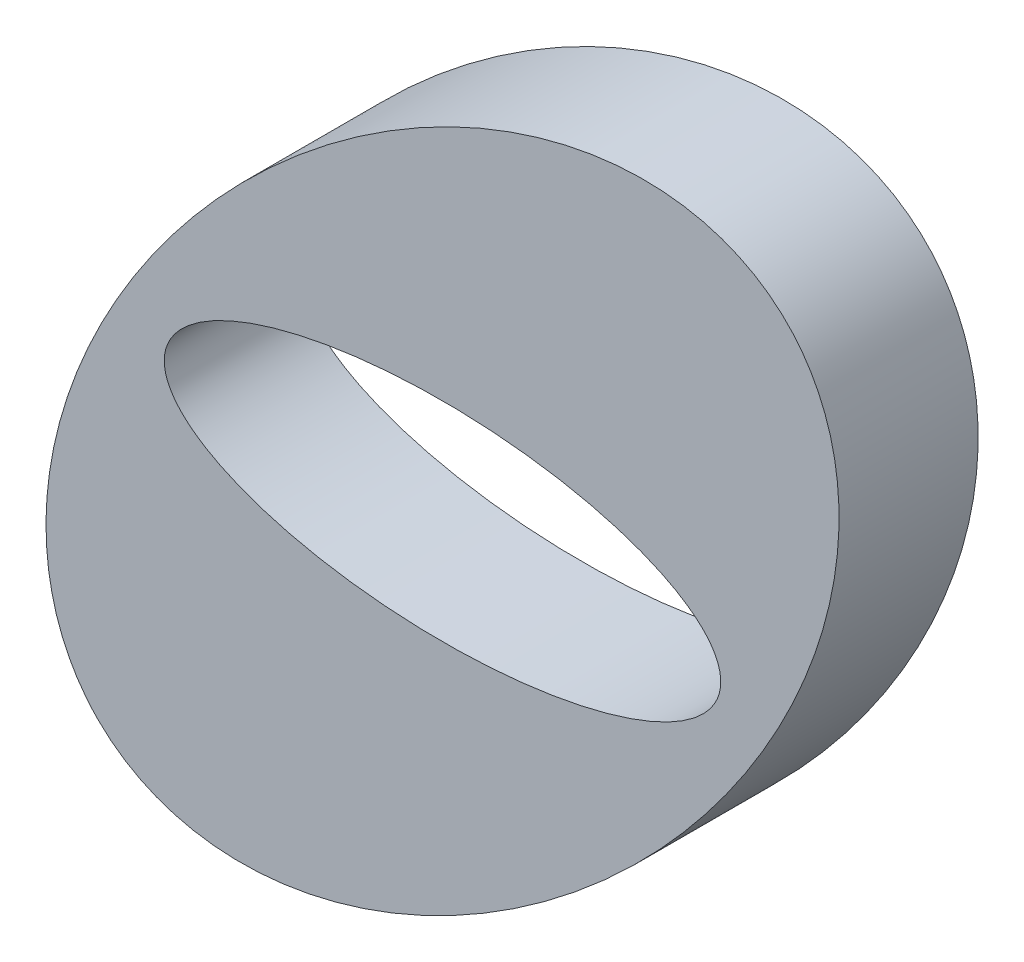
from build123d import *

# Parameters (mm, degrees)
SKETCH1_RX     = 70
SKETCH1_RY     = 40
SKETCH1_RX_2   = 40
SKETCH1_RY_2   = 15
EXTRUDE1_DEPTH = 20


with BuildPart() as part:
    # Sketch1 → Extrude1 (new body)
    with BuildSketch(Plane.XY):
        with Locations(Location((0, 0), (0, 0, -135))):
            Ellipse(SKETCH1_RX, SKETCH1_RY)
        with Locations((0, 0)):
            Ellipse(SKETCH1_RX_2, SKETCH1_RY_2, mode=Mode.SUBTRACT)
    extrude(amount=EXTRUDE1_DEPTH)


solid = part.part
